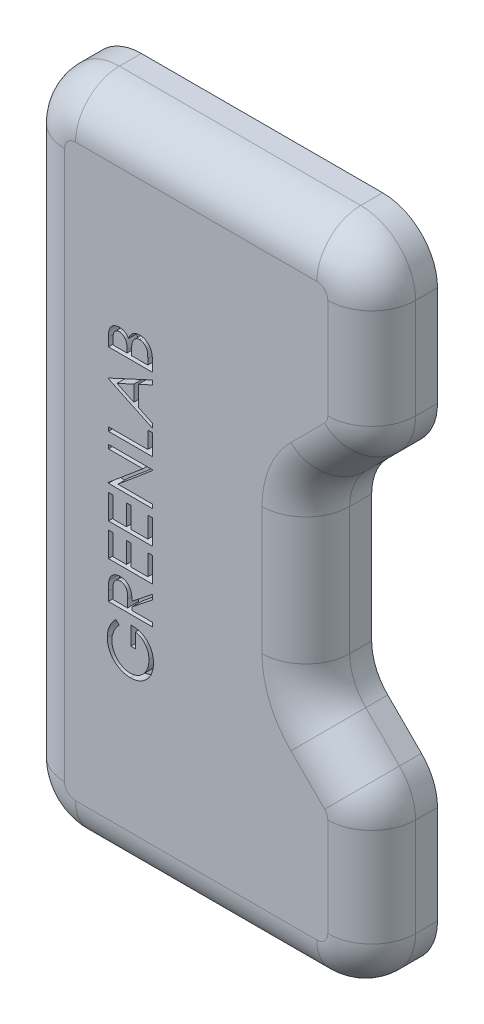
from build123d import *

# Parameters (mm, degrees)
BOSS_EXTRUDE1_DEPTH = 3
FILLET1_R           = 2
CUT_EXTRUDE1_DEPTH  = 0.5


with BuildPart() as part:
    # Sketch1 → Boss-Extrude1 (new body)
    with BuildSketch(Plane.XY):
        with BuildLine():
            Line((-8.000004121, 12.537277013), (-8.000004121, -12.462722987))
            ThreePointArc((-8.000004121, -12.462722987), (-7.267771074, -14.23048994), (-5.500004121, -14.962722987))
            Line((-5.500004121, -14.962722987), (5.499995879, -14.962722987))
            ThreePointArc((5.499995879, -14.962722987), (7.267762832, -14.23048994), (7.999995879, -12.462722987))
            Line((7.999995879, -12.462722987), (7.999995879, -7.974876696))
            ThreePointArc((7.999995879, -7.974876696), (7.80969471, -7.018168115), (7.267762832, -6.207109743))
            Line((7.267762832, -6.207109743), (5.732228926, -4.671575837))
            ThreePointArc((5.732228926, -4.671575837), (5.190297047, -3.860517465), (4.999995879, -2.903808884))
            Line((4.999995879, -2.903808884), (4.999995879, 2.903816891))
            ThreePointArc((4.999995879, 2.903816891), (5.190297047, 3.860525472), (5.732228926, 4.671583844))
            Line((5.732228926, 4.671583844), (7.267762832, 6.20711775))
            ThreePointArc((7.267762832, 6.20711775), (7.80969471, 7.018176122), (7.999995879, 7.974884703))
            Line((7.999995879, 7.974884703), (7.999995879, 12.537277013))
            ThreePointArc((7.999995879, 12.537277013), (7.267762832, 14.305043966), (5.499995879, 15.037277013))
            Line((5.499995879, 15.037277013), (-5.500004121, 15.037277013))
            ThreePointArc((-5.500004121, 15.037277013), (-7.267771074, 14.305043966), (-8.000004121, 12.537277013))
        make_face()
    extrude(amount=BOSS_EXTRUDE1_DEPTH)

    # Fillet1
    fillet1_edges = [part.edges().sort_by_distance(p)[0] for p in [
        (7.80969471, -7.018168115, 3),
        (6.499995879, -5.43934279, 3),
        (5.190297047, -3.860517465, 3),
        (4.999995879, 4.003e-06, 3),
        (5.190297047, 3.860525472, 3),
        (6.499995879, 5.439350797, 3),
        (7.80969471, 7.018176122, 3),
        (7.999995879, 10.256080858, 3),
        (7.267762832, 14.305043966, 3),
        (-4.121e-06, 15.037277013, 3),
        (7.267762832, -14.23048994, 3),
        (-7.267771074, 14.305043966, 3),
        (-8.000004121, 0.037277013, 3),
        (-7.267771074, -14.23048994, 3),
        (-4.121e-06, -14.962722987, 3),
        (7.999995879, -10.218799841, 3),
    ]]
    fillet(fillet1_edges, radius=FILLET1_R)

    # Sketch2 → Cut-Extrude1 (cut)
    # profile 1 of 8: a face of its own
    with BuildSketch(Plane.XY.offset(3)):
        with BuildLine():
            Line((-3.658657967, -4.88579991), (-3.512824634, -5.039646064))
            add(Edge.make_bspline(
                [(-3.512824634, -5.039646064), (-3.539022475, -5.067479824), (-3.590793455, -5.122483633), (-3.657857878, -5.212312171), (-3.715876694, -5.305658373), (-3.762731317, -5.402673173), (-3.799486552, -5.500812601), (-3.826204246, -5.598389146), (-3.843124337, -5.694771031), (-3.845156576, -5.758864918), (-3.846157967, -5.790447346)],
                knots=[0, 0, 0, 0, 1.089067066, 2.152164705, 3.18986567, 4.218445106, 5.218487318, 6.173592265, 7.100032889, 8, 8, 8, 8], degree=3))
            add(Edge.make_bspline(
                [(-3.846157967, -5.790447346), (-3.845921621, -5.809827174), (-3.845449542, -5.848536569), (-3.839424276, -5.906034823), (-3.830758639, -5.962930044), (-3.818220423, -6.019114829), (-3.802329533, -6.074698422), (-3.782452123, -6.129487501), (-3.759277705, -6.183584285), (-3.732499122, -6.236479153), (-3.703082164, -6.287759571), (-3.670482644, -6.33619157), (-3.635747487, -6.382086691), (-3.597999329, -6.424571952), (-3.557608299, -6.46392996), (-3.515301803, -6.500884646), (-3.470248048, -6.534747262), (-3.422632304, -6.564910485), (-3.373562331, -6.59214911), (-3.32345429, -6.61568751), (-3.272773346, -6.636150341), (-3.22113788, -6.651735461), (-3.169080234, -6.664935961), (-3.116327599, -6.674125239), (-3.062742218, -6.679323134), (-3.026857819, -6.680220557), (-3.008818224, -6.680671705)],
                knots=[0, 0, 0, 0, 1.028150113, 2.053633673, 3.06513288, 4.081487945, 5.106702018, 6.131327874, 7.172780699, 8.228344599, 9.276313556, 10.308389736, 11.324843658, 12.329040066, 13.321460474, 14.316307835, 15.308626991, 16.309440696, 17.305625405, 18.28535951, 19.246194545, 20.203493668, 21.145557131, 22.095268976, 23.042464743, 24, 24, 24, 24], degree=3))
            add(Edge.make_bspline(
                [(-3.008818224, -6.680671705), (-2.990377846, -6.680239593), (-2.953547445, -6.67937655), (-2.898578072, -6.673860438), (-2.844431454, -6.663600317), (-2.791022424, -6.649993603), (-2.738244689, -6.632694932), (-2.686153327, -6.611442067), (-2.634753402, -6.586124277), (-2.584555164, -6.556883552), (-2.535697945, -6.524592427), (-2.489290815, -6.489077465), (-2.445873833, -6.450278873), (-2.404812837, -6.408908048), (-2.366366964, -6.36458805), (-2.33099962, -6.316888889), (-2.298163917, -6.266478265), (-2.268220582, -6.213333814), (-2.241473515, -6.158017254), (-2.217688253, -6.101299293), (-2.198100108, -6.042997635), (-2.182135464, -5.983418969), (-2.169049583, -5.922634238), (-2.160631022, -5.860334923), (-2.154521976, -5.79697909), (-2.154075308, -5.7542713), (-2.153850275, -5.732755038)],
                knots=[0, 0, 0, 0, 0.935915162, 1.869274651, 2.799799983, 3.730201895, 4.664668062, 5.616159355, 6.583070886, 7.570012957, 8.562524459, 9.553461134, 10.53281078, 11.515274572, 12.509912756, 13.507571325, 14.526460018, 15.561318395, 16.601025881, 17.643204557, 18.680545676, 19.719612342, 20.772381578, 21.833430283, 22.908478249, 24, 24, 24, 24], degree=3))
            add(Edge.make_bspline(
                [(-2.153850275, -5.732755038), (-2.154392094, -5.706824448), (-2.155456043, -5.655905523), (-2.163745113, -5.581057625), (-2.176674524, -5.509164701), (-2.195668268, -5.440460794), (-2.219709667, -5.374696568), (-2.249440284, -5.312114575), (-2.284547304, -5.252542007), (-2.324319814, -5.196236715), (-2.368633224, -5.144537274), (-2.416024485, -5.097484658), (-2.467107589, -5.056696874), (-2.521121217, -5.02095555), (-2.578582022, -4.991414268), (-2.639170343, -4.96715948), (-2.702923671, -4.948569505), (-2.746975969, -4.940938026), (-2.769234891, -4.937081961)],
                knots=[0, 0, 0, 0, 1.130199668, 2.219330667, 3.279027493, 4.311506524, 5.322739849, 6.327972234, 7.327472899, 8.33386792, 9.329086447, 10.29244429, 11.240784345, 12.174119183, 13.111530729, 14.052100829, 15.015757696, 16, 16, 16, 16], degree=3))
            Line((-2.769234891, -4.937081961), (-2.769234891, -5.603748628))
            Line((-2.769234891, -5.603748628), (-2.974363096, -5.603748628))
            Line((-2.974363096, -5.603748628), (-2.974363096, -4.757594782))
            add(Edge.make_bspline(
                [(-2.974363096, -4.757594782), (-2.936130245, -4.758569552), (-2.86130165, -4.760477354), (-2.752175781, -4.773859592), (-2.649106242, -4.795469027), (-2.551984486, -4.824989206), (-2.460948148, -4.863203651), (-2.375904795, -4.909702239), (-2.297403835, -4.965229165), (-2.224804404, -5.027806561), (-2.160044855, -5.098035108), (-2.103127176, -5.174017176), (-2.055182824, -5.255878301), (-2.016176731, -5.343541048), (-1.985734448, -5.436718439), (-1.96415069, -5.535626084), (-1.951219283, -5.640129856), (-1.949567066, -5.711750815), (-1.94872207, -5.748380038)],
                knots=[0, 0, 0, 0, 1.140356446, 2.231883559, 3.274166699, 4.278491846, 5.25512956, 6.21435461, 7.1637429, 8.11826594, 9.068280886, 10.0076534, 10.945064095, 11.891975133, 12.864533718, 13.863980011, 14.907571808, 16, 16, 16, 16], degree=3))
            add(Edge.make_bspline(
                [(-1.94872207, -5.748380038), (-1.949047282, -5.770957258), (-1.949688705, -5.815486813), (-1.95424719, -5.881253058), (-1.961264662, -5.945205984), (-1.971861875, -6.007336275), (-1.984841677, -6.06787247), (-2.00146266, -6.126512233), (-2.020701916, -6.183478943), (-2.042585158, -6.238860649), (-2.067940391, -6.292154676), (-2.096117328, -6.3435984), (-2.126970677, -6.393476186), (-2.161034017, -6.44144828), (-2.198052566, -6.487764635), (-2.238100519, -6.532126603), (-2.281055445, -6.574782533), (-2.311557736, -6.601502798), (-2.326927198, -6.614966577)],
                knots=[0, 0, 0, 0, 1.107784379, 2.184907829, 3.233506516, 4.263428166, 5.276301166, 6.270063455, 7.25232949, 8.225834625, 9.190232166, 10.146266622, 11.1027726, 12.066435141, 13.031522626, 14.010570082, 14.99756817, 16, 16, 16, 16], degree=3))
            add(Edge.make_bspline(
                [(-2.326927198, -6.614966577), (-2.351310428, -6.634501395), (-2.399672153, -6.673246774), (-2.477157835, -6.723120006), (-2.557387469, -6.765635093), (-2.6405844, -6.800130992), (-2.726670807, -6.827067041), (-2.815536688, -6.8463849), (-2.907296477, -6.857703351), (-2.969390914, -6.859333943), (-3.000805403, -6.860158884)],
                knots=[0, 0, 0, 0, 1.023165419, 2.029347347, 3.013907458, 3.994755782, 4.975994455, 5.96558838, 6.970761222, 8, 8, 8, 8], degree=3))
            add(Edge.make_bspline(
                [(-3.000805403, -6.860158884), (-3.024328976, -6.859854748), (-3.071077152, -6.859250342), (-3.140481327, -6.851921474), (-3.208653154, -6.841406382), (-3.275536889, -6.82595091), (-3.341177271, -6.806467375), (-3.405604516, -6.782150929), (-3.468857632, -6.753840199), (-3.53049751, -6.720931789), (-3.589720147, -6.684321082), (-3.646235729, -6.644545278), (-3.699128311, -6.601297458), (-3.748520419, -6.55445169), (-3.795144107, -6.504952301), (-3.838025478, -6.451760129), (-3.877835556, -6.39568108), (-3.91380939, -6.336280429), (-3.946133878, -6.274495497), (-3.974469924, -6.210460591), (-3.997889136, -6.14419898), (-4.01775982, -6.07620609), (-4.032454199, -6.005967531), (-4.043110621, -5.933992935), (-4.050402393, -5.859907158), (-4.050988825, -5.809829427), (-4.051286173, -5.784437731)],
                knots=[0, 0, 0, 0, 1.00895651, 2.005089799, 2.991467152, 3.967318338, 4.948153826, 5.927364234, 6.919980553, 7.91976625, 8.923240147, 9.905815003, 10.88314567, 11.851989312, 12.825009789, 13.798721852, 14.781296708, 15.773896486, 16.776076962, 17.771600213, 18.775744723, 19.78957137, 20.808953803, 21.851964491, 22.910847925, 24, 24, 24, 24], degree=3))
            add(Edge.make_bspline(
                [(-4.051286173, -5.784437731), (-4.050955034, -5.763730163), (-4.050298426, -5.722669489), (-4.045747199, -5.661569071), (-4.038533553, -5.601413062), (-4.028689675, -5.542112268), (-4.015281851, -5.48386863), (-3.999237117, -5.426516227), (-3.980556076, -5.369971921), (-3.958276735, -5.314412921), (-3.932988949, -5.259465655), (-3.904524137, -5.204824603), (-3.872395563, -5.150676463), (-3.836507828, -5.09692733), (-3.797477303, -5.043238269), (-3.75418769, -4.990458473), (-3.708346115, -4.937313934), (-3.675384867, -4.903141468), (-3.658657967, -4.88579991)],
                knots=[0, 0, 0, 0, 0.985871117, 1.954866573, 2.915460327, 3.869826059, 4.81536089, 5.759505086, 6.70452669, 7.649098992, 8.607881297, 9.583363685, 10.581137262, 11.603961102, 12.659522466, 13.73993555, 14.853081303, 16, 16, 16, 16], degree=3))
        make_face()
    # profile 2 of 8: a face of its own
    with BuildSketch(Plane.XY.offset(3)):
        with BuildLine():
            Line((-4.000004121, -4.347338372), (-4.000004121, -3.947097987))
            add(Edge.make_bspline(
                [(-4.000004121, -3.947097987), (-3.999915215, -3.920388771), (-3.999744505, -3.869104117), (-3.998792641, -3.795633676), (-3.996064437, -3.728875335), (-3.993716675, -3.668863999), (-3.989435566, -3.615600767), (-3.985343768, -3.568922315), (-3.97998739, -3.529043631), (-3.975012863, -3.504903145), (-3.972760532, -3.493972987)],
                knots=[0, 0, 0, 0, 1.410062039, 2.707475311, 3.878576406, 4.937260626, 5.877586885, 6.699081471, 7.410979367, 8, 8, 8, 8], degree=3))
            add(Edge.make_bspline(
                [(-3.972760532, -3.493972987), (-3.969145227, -3.479340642), (-3.961991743, -3.450388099), (-3.946872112, -3.408702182), (-3.929374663, -3.36898032), (-3.908825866, -3.331383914), (-3.885061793, -3.296114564), (-3.858535, -3.262758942), (-3.829299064, -3.231425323), (-3.797090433, -3.202522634), (-3.762595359, -3.176268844), (-3.725908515, -3.153240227), (-3.687181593, -3.133781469), (-3.646354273, -3.118511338), (-3.603877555, -3.105698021), (-3.559317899, -3.09708905), (-3.51282406, -3.091726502), (-3.481189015, -3.091196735), (-3.465148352, -3.090928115)],
                knots=[0, 0, 0, 0, 1.02737844, 2.032840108, 3.019645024, 3.985760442, 4.950801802, 5.916702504, 6.889791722, 7.870143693, 8.864820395, 9.842884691, 10.820524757, 11.815201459, 12.812418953, 13.84314332, 14.906358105, 16, 16, 16, 16], degree=3))
            add(Edge.make_bspline(
                [(-3.465148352, -3.090928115), (-3.438499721, -3.091767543), (-3.386501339, -3.093405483), (-3.311037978, -3.108676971), (-3.240644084, -3.133692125), (-3.175408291, -3.168162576), (-3.116602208, -3.212059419), (-3.064950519, -3.264816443), (-3.021727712, -3.326463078), (-2.991754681, -3.383851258), (-2.972558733, -3.434545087), (-2.959052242, -3.476278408), (-2.948616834, -3.521802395), (-2.939268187, -3.570680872), (-2.932210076, -3.623117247), (-2.927040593, -3.678985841), (-2.923809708, -3.738326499), (-2.923328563, -3.779091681), (-2.923081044, -3.800062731)],
                knots=[0, 0, 0, 0, 1.260483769, 2.459530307, 3.627416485, 4.787058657, 5.939039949, 7.08810263, 8.267026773, 9.491475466, 10.141966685, 10.831826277, 11.566392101, 12.351337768, 13.187381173, 14.07005841, 15.007169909, 16, 16, 16, 16], degree=3))
            Line((-2.923081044, -3.800062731), (-2.000004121, -3.065287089))
            Line((-2.000004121, -3.065287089), (-2.000004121, -3.287242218))
            Line((-2.000004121, -3.287242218), (-2.923081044, -4.022017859))
            Line((-2.923081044, -4.022017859), (-2.923081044, -4.167851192))
            Line((-2.923081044, -4.167851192), (-2.000004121, -4.167851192))
            Line((-2.000004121, -4.167851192), (-2.000004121, -4.347338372))
            Line((-2.000004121, -4.347338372), (-4.000004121, -4.347338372))
        make_face()
        with BuildLine():
            Line((-3.794875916, -4.167851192), (-3.128209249, -4.167851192))
            Line((-3.128209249, -4.167851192), (-3.125404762, -3.801665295))
            add(Edge.make_bspline(
                [(-3.125404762, -3.801665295), (-3.125397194, -3.784568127), (-3.125382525, -3.751428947), (-3.127664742, -3.703485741), (-3.130260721, -3.658845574), (-3.134232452, -3.617679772), (-3.139347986, -3.579968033), (-3.145756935, -3.545735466), (-3.153191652, -3.514905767), (-3.164818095, -3.479065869), (-3.182433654, -3.438571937), (-3.209793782, -3.395526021), (-3.242668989, -3.357756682), (-3.281346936, -3.326996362), (-3.323197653, -3.301224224), (-3.368649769, -3.283880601), (-3.416228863, -3.272321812), (-3.448919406, -3.271058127), (-3.465548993, -3.270415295)],
                knots=[0, 0, 0, 0, 1.146477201, 2.22219935, 3.21835465, 4.145220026, 4.995151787, 5.769831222, 6.480173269, 7.120302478, 8.295254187, 9.430763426, 10.528629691, 11.636497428, 12.733230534, 13.811001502, 14.886462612, 16, 16, 16, 16], degree=3))
            add(Edge.make_bspline(
                [(-3.465548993, -3.270415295), (-3.481631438, -3.271104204), (-3.513500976, -3.27246937), (-3.560180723, -3.283553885), (-3.604250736, -3.302503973), (-3.645767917, -3.327432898), (-3.682865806, -3.358718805), (-3.714951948, -3.394698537), (-3.741218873, -3.435365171), (-3.758676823, -3.473038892), (-3.768929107, -3.506982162), (-3.776380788, -3.536313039), (-3.781552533, -3.569617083), (-3.786451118, -3.606742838), (-3.790416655, -3.647761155), (-3.793152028, -3.692792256), (-3.794753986, -3.741557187), (-3.794834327, -3.775355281), (-3.794875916, -3.792851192)],
                knots=[0, 0, 0, 0, 1.100823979, 2.181431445, 3.263702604, 4.376021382, 5.48638238, 6.575013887, 7.666064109, 8.791843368, 9.405226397, 10.093019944, 10.863016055, 11.711746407, 12.658404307, 13.684961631, 14.801597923, 16, 16, 16, 16], degree=3))
            Line((-3.794875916, -3.792851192), (-3.794875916, -4.167851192))
        make_face(mode=Mode.SUBTRACT)
    # profile 3 of 8: a face of its own
    with BuildSketch(Plane.XY.offset(3)):
        Polygon((-4.000004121, -2.655030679), (-4.000004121, -1.526825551), (-3.794875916, -1.526825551), (-3.794875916, -2.4755435), (-3.179491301, -2.4755435), (-3.179491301, -1.526825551), (-2.974363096, -1.526825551), (-2.974363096, -2.4755435), (-2.205132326, -2.4755435), (-2.205132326, -1.526825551), (-2.000004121, -1.526825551), (-2.000004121, -2.655030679), align=None)
    # profile 4 of 8: a face of its own
    with BuildSketch(Plane.XY.offset(3)):
        Polygon((-4.000004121, -1.167851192), (-4.000004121, -0.039646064), (-3.794875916, -0.039646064), (-3.794875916, -0.988364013), (-3.179491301, -0.988364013), (-3.179491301, -0.039646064), (-2.974363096, -0.039646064), (-2.974363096, -0.988364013), (-2.205132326, -0.988364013), (-2.205132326, -0.039646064), (-2.000004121, -0.039646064), (-2.000004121, -1.167851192), align=None)
    # profile 5 of 8: a face of its own
    with BuildSketch(Plane.XY.offset(3)):
        Polygon((-2.000004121, 0.319328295), (-4.000004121, 0.319328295), (-4.000004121, 0.356988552), (-2.425885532, 1.678302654), (-4.000004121, 1.678302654), (-4.000004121, 1.857789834), (-2.000004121, 1.857789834), (-2.000004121, 1.816924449), (-3.570516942, 0.498815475), (-2.000004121, 0.498815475), align=None)
    # profile 6 of 8: a face of its own
    with BuildSketch(Plane.XY.offset(3)):
        Polygon((-4.000004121, 2.370610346), (-4.000004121, 2.550097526), (-2.205132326, 2.550097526), (-2.205132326, 3.319328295), (-2.000004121, 3.319328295), (-2.000004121, 2.370610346), align=None)
    # profile 7 of 8: a face of its own
    with BuildSketch(Plane.XY.offset(3)):
        Polygon((-4.000004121, 4.473174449), (-2.000004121, 5.396251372), (-2.000004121, 5.201139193), (-2.641029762, 4.905466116), (-2.641029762, 3.998815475), (-2.000004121, 3.694728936), (-2.000004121, 3.498815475), (-4.000004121, 4.447533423), align=None)
        Polygon((-3.610180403, 4.458350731), (-2.846157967, 4.096171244), (-2.846157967, 4.810914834), align=None, mode=Mode.SUBTRACT)
    # profile 8 of 8: a face of its own
    with BuildSketch(Plane.XY.offset(3)):
        with BuildLine():
            Line((-4.000004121, 5.70394368), (-4.000004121, 6.094168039))
            add(Edge.make_bspline(
                [(-4.000004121, 6.094168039), (-3.999905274, 6.113270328), (-3.999713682, 6.150295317), (-3.996673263, 6.204130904), (-3.992631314, 6.254572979), (-3.985851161, 6.301532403), (-3.978821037, 6.345314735), (-3.968502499, 6.385475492), (-3.957105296, 6.422351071), (-3.939569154, 6.466631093), (-3.912335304, 6.516872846), (-3.871944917, 6.570873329), (-3.823520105, 6.617813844), (-3.768336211, 6.657727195), (-3.707627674, 6.689758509), (-3.642700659, 6.712638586), (-3.574647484, 6.727337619), (-3.52799074, 6.728830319), (-3.504411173, 6.729584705)],
                knots=[0, 0, 0, 0, 1.00128172, 1.940733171, 2.826250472, 3.653024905, 4.427672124, 5.149348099, 5.824709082, 6.450061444, 7.643590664, 8.808605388, 9.972104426, 11.165284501, 12.367876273, 13.557044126, 14.765369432, 16, 16, 16, 16], degree=3))
            add(Edge.make_bspline(
                [(-3.504411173, 6.729584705), (-3.482324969, 6.728956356), (-3.438923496, 6.727721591), (-3.375553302, 6.71605818), (-3.315291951, 6.697546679), (-3.258191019, 6.671963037), (-3.205313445, 6.638999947), (-3.156823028, 6.599505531), (-3.11455244, 6.552053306), (-3.09092969, 6.516482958), (-3.078930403, 6.498414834)],
                knots=[0, 0, 0, 0, 1.044641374, 2.052818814, 3.038628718, 4.023282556, 5.005660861, 5.98021751, 6.974042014, 8, 8, 8, 8], degree=3))
            add(Edge.make_bspline(
                [(-3.078930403, 6.498414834), (-3.070204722, 6.521132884), (-3.053510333, 6.564598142), (-3.024040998, 6.624447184), (-2.991872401, 6.67582289), (-2.957285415, 6.719728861), (-2.919454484, 6.757081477), (-2.87807225, 6.789431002), (-2.833172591, 6.817397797), (-2.784920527, 6.841197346), (-2.733725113, 6.859892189), (-2.68021165, 6.873632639), (-2.624585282, 6.881760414), (-2.586836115, 6.882869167), (-2.567712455, 6.883430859)],
                knots=[0, 0, 0, 0, 1.272586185, 2.434772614, 3.483318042, 4.437947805, 5.351807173, 6.25737843, 7.180033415, 8.1141739, 9.066731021, 10.025721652, 10.999834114, 12, 12, 12, 12], degree=3))
            add(Edge.make_bspline(
                [(-2.567712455, 6.883430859), (-2.548188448, 6.882872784), (-2.509774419, 6.881774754), (-2.453344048, 6.87367017), (-2.399411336, 6.859957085), (-2.347652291, 6.841035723), (-2.298175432, 6.816510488), (-2.251159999, 6.786232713), (-2.206508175, 6.750627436), (-2.164141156, 6.710387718), (-2.125374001, 6.665543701), (-2.092047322, 6.616122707), (-2.063391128, 6.563478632), (-2.040060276, 6.506938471), (-2.02206054, 6.446646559), (-2.009519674, 6.382636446), (-2.00105548, 6.315013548), (-2.000360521, 6.268607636), (-2.000004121, 6.244809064)],
                knots=[0, 0, 0, 0, 0.978680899, 1.925582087, 2.851223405, 3.764209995, 4.683484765, 5.614004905, 6.562443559, 7.542772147, 8.539900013, 9.527881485, 10.525548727, 11.540192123, 12.58875426, 13.674701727, 14.807505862, 16, 16, 16, 16], degree=3))
            Line((-2.000004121, 6.244809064), (-2.000004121, 5.70394368))
            Line((-2.000004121, 5.70394368), (-4.000004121, 5.70394368))
        make_face()
        with BuildLine():
            Line((-3.794875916, 5.883430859), (-3.153850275, 5.883430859))
            Line((-3.153850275, 5.883430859), (-3.153850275, 6.004023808))
            add(Edge.make_bspline(
                [(-3.153850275, 6.004023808), (-3.154078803, 6.021651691), (-3.154520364, 6.055712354), (-3.155785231, 6.105038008), (-3.159326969, 6.150823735), (-3.162867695, 6.192990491), (-3.168624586, 6.231471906), (-3.175477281, 6.266182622), (-3.182724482, 6.297667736), (-3.195050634, 6.333975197), (-3.213261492, 6.375165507), (-3.241550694, 6.419047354), (-3.275218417, 6.457912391), (-3.314429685, 6.490338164), (-3.35713765, 6.517110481), (-3.402967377, 6.535865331), (-3.450996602, 6.548368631), (-3.484032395, 6.549515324), (-3.500805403, 6.550097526)],
                knots=[0, 0, 0, 0, 1.156917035, 2.235399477, 3.236897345, 4.169954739, 5.01148057, 5.788325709, 6.491867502, 7.129259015, 8.302032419, 9.437271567, 10.542795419, 11.662606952, 12.764338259, 13.836858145, 14.901724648, 16, 16, 16, 16], degree=3))
            add(Edge.make_bspline(
                [(-3.500805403, 6.550097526), (-3.511907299, 6.54980192), (-3.533684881, 6.549222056), (-3.565534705, 6.544300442), (-3.595461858, 6.536326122), (-3.623753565, 6.525526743), (-3.649706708, 6.510773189), (-3.674561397, 6.493671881), (-3.696828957, 6.472557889), (-3.717581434, 6.448697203), (-3.736154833, 6.421396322), (-3.751540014, 6.390067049), (-3.765484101, 6.355519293), (-3.775806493, 6.316815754), (-3.784883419, 6.274758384), (-3.790586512, 6.228777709), (-3.794256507, 6.179165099), (-3.794664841, 6.144789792), (-3.794875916, 6.127020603)],
                knots=[0, 0, 0, 0, 0.911708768, 1.788416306, 2.640049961, 3.452993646, 4.268229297, 5.087074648, 5.92553149, 6.781184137, 7.681934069, 8.628939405, 9.643570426, 10.73771997, 11.914765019, 13.176320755, 14.540391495, 16, 16, 16, 16], degree=3))
            Line((-3.794875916, 6.127020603), (-3.794875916, 5.883430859))
        make_face(mode=Mode.SUBTRACT)
        with BuildLine():
            Line((-2.94872207, 5.883430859), (-2.205132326, 5.883430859))
            Line((-2.205132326, 5.883430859), (-2.205132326, 6.139039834))
            add(Edge.make_bspline(
                [(-2.205132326, 6.139039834), (-2.205373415, 6.157334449), (-2.205838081, 6.192594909), (-2.20692782, 6.243545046), (-2.211050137, 6.290644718), (-2.214852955, 6.334042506), (-2.221355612, 6.373623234), (-2.227492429, 6.409691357), (-2.236602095, 6.441654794), (-2.24912226, 6.479059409), (-2.269165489, 6.520869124), (-2.298448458, 6.566559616), (-2.334588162, 6.606401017), (-2.375690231, 6.640601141), (-2.420257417, 6.668824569), (-2.467707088, 6.689077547), (-2.51711644, 6.701663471), (-2.550813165, 6.70318208), (-2.567712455, 6.70394368)],
                knots=[0, 0, 0, 0, 1.160376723, 2.23647316, 3.230273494, 4.158083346, 4.997711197, 5.773399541, 6.476071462, 7.102777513, 8.27340052, 9.405620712, 10.53304798, 11.669441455, 12.787990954, 13.865552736, 14.929550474, 16, 16, 16, 16], degree=3))
            add(Edge.make_bspline(
                [(-2.567712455, 6.70394368), (-2.578280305, 6.703786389), (-2.599245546, 6.703474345), (-2.630051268, 6.698746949), (-2.659906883, 6.691907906), (-2.688936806, 6.682900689), (-2.716652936, 6.670309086), (-2.743161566, 6.654872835), (-2.768996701, 6.637203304), (-2.802080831, 6.60994256), (-2.839725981, 6.569712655), (-2.87612764, 6.512541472), (-2.905958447, 6.447894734), (-2.918569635, 6.400897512), (-2.925084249, 6.376619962)],
                knots=[0, 0, 0, 0, 0.723302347, 1.434937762, 2.129609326, 2.821140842, 3.513216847, 4.209993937, 4.920569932, 5.655069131, 7.14393391, 8.6716197, 10.280644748, 12, 12, 12, 12], degree=3))
            add(Edge.make_bspline(
                [(-2.925084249, 6.376619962), (-2.927058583, 6.36688905), (-2.931339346, 6.345790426), (-2.935858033, 6.311386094), (-2.939883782, 6.272108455), (-2.942861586, 6.227866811), (-2.945939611, 6.178605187), (-2.947136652, 6.124218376), (-2.948564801, 6.064928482), (-2.948668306, 6.023789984), (-2.94872207, 6.002421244)],
                knots=[0, 0, 0, 0, 0.634451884, 1.375622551, 2.216452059, 3.157844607, 4.20941857, 5.370758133, 6.634282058, 8, 8, 8, 8], degree=3))
            Line((-2.94872207, 6.002421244), (-2.94872207, 5.883430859))
        make_face(mode=Mode.SUBTRACT)
    extrude(amount=-CUT_EXTRUDE1_DEPTH, mode=Mode.SUBTRACT)


solid = part.part
